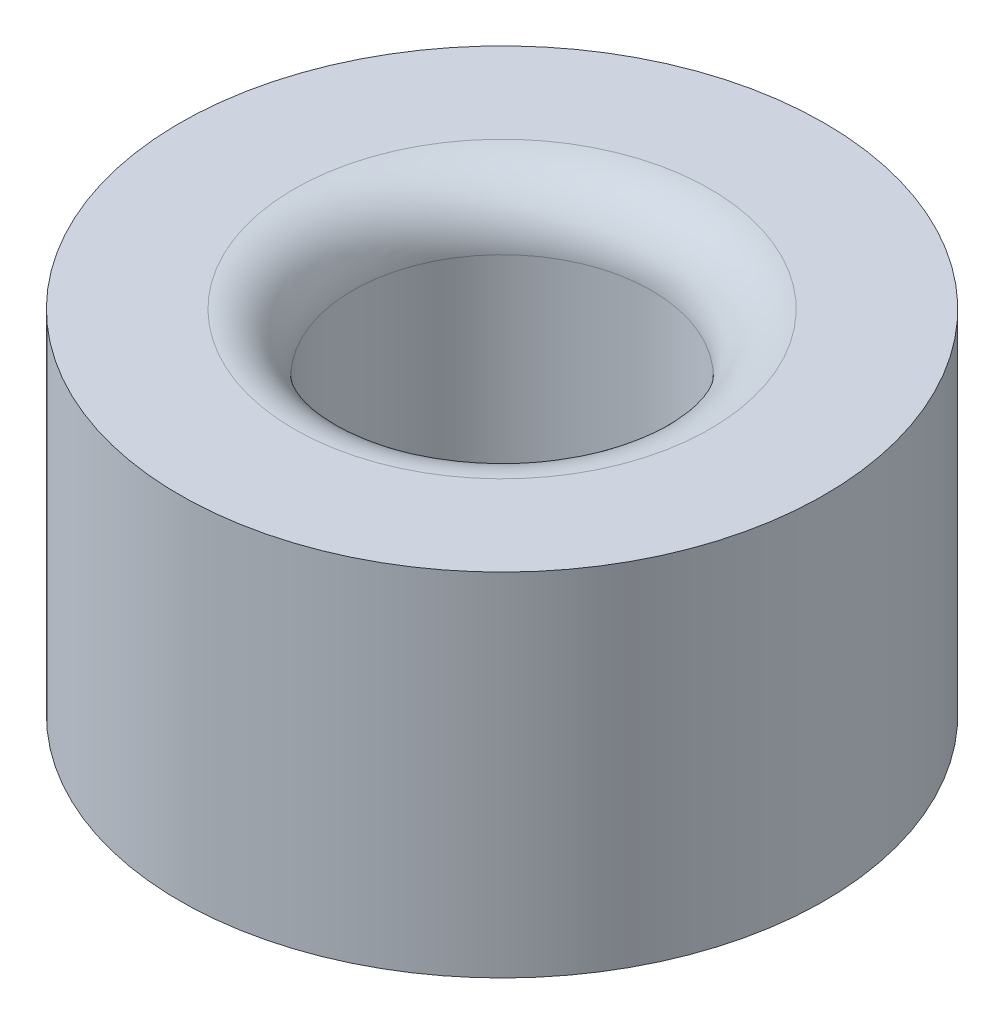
from build123d import *

# Parameters (mm, degrees)
SKETCH1_R           = 13.97
SKETCH1_R_2         = 6.477
BOSS_EXTRUDE1_DEPTH = 15.24
FILLET1_R           = 2.54


with BuildPart() as part:
    # Sketch1 → Boss-Extrude1 (new body)
    with BuildSketch(Plane(origin=(0, 0, 0), x_dir=(1, 0, 0), z_dir=(0, 1, 0))):
        with Locations(Location((0, 0, 0), (0, 0, 90))):
            Circle(SKETCH1_R)
        with Locations(Location((0, 0, 0), (0, 0, 90))):
            Circle(SKETCH1_R_2, mode=Mode.SUBTRACT)
    extrude(amount=BOSS_EXTRUDE1_DEPTH)

    # Fillet1
    fillet1_edges = [part.edges().sort_by_distance(p)[0] for p in [
        (0, 0, 6.477),
        (0, 15.24, 6.477),
    ]]
    fillet(fillet1_edges, radius=FILLET1_R)


solid = part.part
